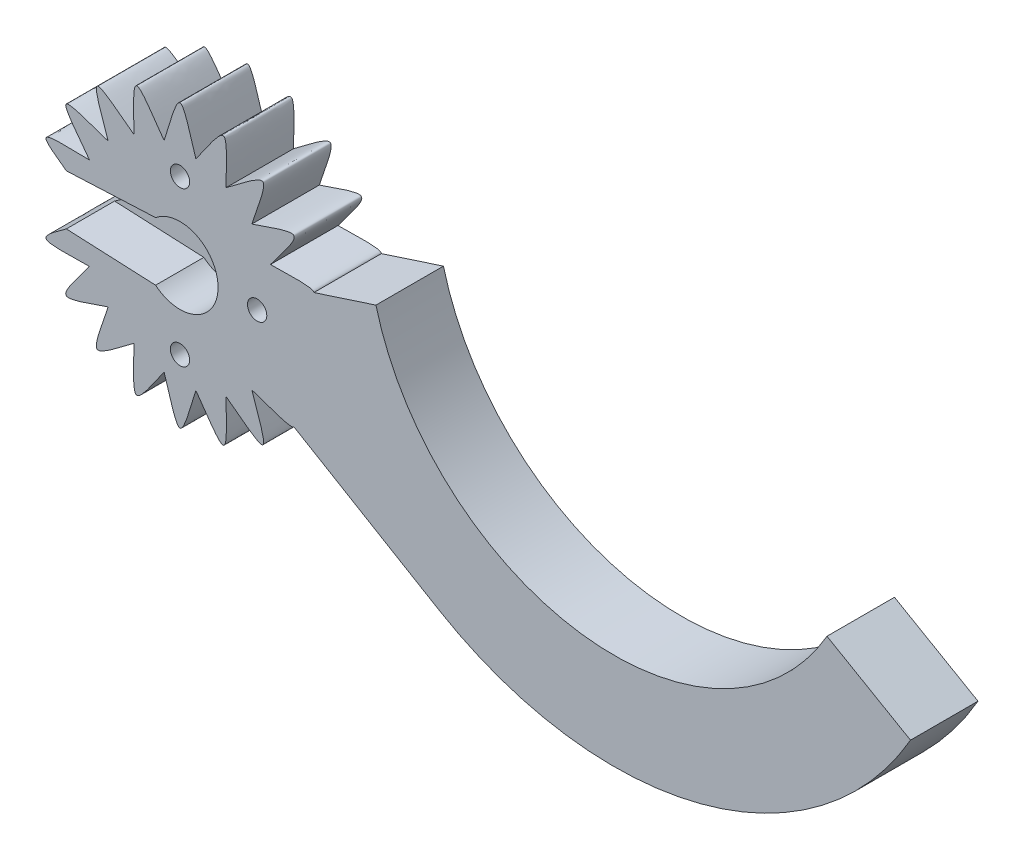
ISO-10303-21;
HEADER;
FILE_DESCRIPTION(('STEP AP214'),'2;1');
FILE_NAME('part.step','',(''),(''),'','','');
FILE_SCHEMA(('AUTOMOTIVE_DESIGN { 1 0 10303 214 1 1 1 1 }'));
ENDSEC;
DATA;
#1=APPLICATION_CONTEXT('core data for automotive mechanical design processes');
#2=APPLICATION_PROTOCOL_DEFINITION('international standard','automotive_design',2000,#1);
#3=PRODUCT_CONTEXT('',#1,'mechanical');
#4=PRODUCT('Part','Part','',(#3));
#5=PRODUCT_RELATED_PRODUCT_CATEGORY('part','',(#4));
#6=PRODUCT_DEFINITION_FORMATION('','',#4);
#7=PRODUCT_DEFINITION_CONTEXT('part definition',#1,'design');
#8=PRODUCT_DEFINITION('design','',#6,#7);
#9=PRODUCT_DEFINITION_SHAPE('','',#8);
#10=(LENGTH_UNIT() NAMED_UNIT(*) SI_UNIT(.MILLI.,.METRE.));
#11=(NAMED_UNIT(*) PLANE_ANGLE_UNIT() SI_UNIT($,.RADIAN.));
#12=(NAMED_UNIT(*) SI_UNIT($,.STERADIAN.) SOLID_ANGLE_UNIT());
#13=UNCERTAINTY_MEASURE_WITH_UNIT(LENGTH_MEASURE(1.E-05),#10,'distance_accuracy_value','');
#14=(GEOMETRIC_REPRESENTATION_CONTEXT(3) GLOBAL_UNCERTAINTY_ASSIGNED_CONTEXT((#13)) GLOBAL_UNIT_ASSIGNED_CONTEXT((#10,
#11,#12)) REPRESENTATION_CONTEXT('',''));
#15=CARTESIAN_POINT('',(0.,0.,0.));
#16=DIRECTION('',(0.,0.,1.));
#17=DIRECTION('',(1.,0.,0.));
#18=AXIS2_PLACEMENT_3D('',#15,#16,#17);
#19=CARTESIAN_POINT('',(-55.4000000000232,-14.647198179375,7.00000000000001));
#20=CARTESIAN_POINT('',(-61.0000000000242,-13.0000000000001,7.));
#21=CARTESIAN_POINT('',(-55.4000000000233,-11.3528018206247,6.99999999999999));
#22=(BOUNDED_CURVE() B_SPLINE_CURVE(2,(#19,#20,#21),.UNSPECIFIED.,.F.,
.F.) B_SPLINE_CURVE_WITH_KNOTS((3,3),(0.,1.),
.UNSPECIFIED.) CURVE() GEOMETRIC_REPRESENTATION_ITEM() RATIONAL_B_SPLINE_CURVE((1.,3.,1.)) REPRESENTATION_ITEM(''));
#23=DIRECTION('',(0.,0.,-1.));
#24=VECTOR('',#23,1.);
#25=SURFACE_OF_LINEAR_EXTRUSION('',#22,#24);
#26=DIRECTION('',(0.,0.,-1.));
#27=VECTOR('',#26,1.);
#28=CARTESIAN_POINT('',(-55.4000000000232,-14.647198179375,7.00000000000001));
#29=LINE('',#28,#27);
#30=CARTESIAN_POINT('',(-55.4000000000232,-14.647198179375,1.99999999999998));
#31=VERTEX_POINT('',#30);
#32=CARTESIAN_POINT('',(-55.4000000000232,-14.647198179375,0.));
#33=VERTEX_POINT('',#32);
#34=EDGE_CURVE('E549',#31,#33,#29,.T.);
#35=ORIENTED_EDGE('',*,*,#34,.F.);
#36=CARTESIAN_POINT('',(-55.4000000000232,-14.647198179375,2.00000000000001));
#37=CARTESIAN_POINT('',(-61.0000000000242,-13.0000000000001,2.));
#38=CARTESIAN_POINT('',(-55.4000000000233,-11.3528018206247,1.99999999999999));
#39=(BOUNDED_CURVE() B_SPLINE_CURVE(2,(#36,#37,#38),.UNSPECIFIED.,.F.,
.F.) B_SPLINE_CURVE_WITH_KNOTS((3,3),(0.,1.),
.UNSPECIFIED.) CURVE() GEOMETRIC_REPRESENTATION_ITEM() RATIONAL_B_SPLINE_CURVE((1.,3.,1.)) REPRESENTATION_ITEM(''));
#40=CARTESIAN_POINT('',(-55.4000000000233,-11.3528018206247,1.99999999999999));
#41=VERTEX_POINT('',#40);
#42=EDGE_CURVE('E440',#31,#41,#39,.T.);
#43=ORIENTED_EDGE('',*,*,#42,.T.);
#44=DIRECTION('',(0.,0.,-1.));
#45=VECTOR('',#44,1.);
#46=CARTESIAN_POINT('',(-55.4000000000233,-11.3528018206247,7.00000000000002));
#47=LINE('',#46,#45);
#48=CARTESIAN_POINT('',(-55.4000000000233,-11.3528018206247,0.));
#49=VERTEX_POINT('',#48);
#50=EDGE_CURVE('E551',#41,#49,#47,.T.);
#51=ORIENTED_EDGE('',*,*,#50,.T.);
#52=CARTESIAN_POINT('',(-55.4000000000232,-14.647198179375,0.));
#53=CARTESIAN_POINT('',(-61.0000000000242,-13.0000000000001,0.));
#54=CARTESIAN_POINT('',(-55.4000000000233,-11.3528018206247,0.));
#55=(BOUNDED_CURVE() B_SPLINE_CURVE(2,(#52,#53,#54),.UNSPECIFIED.,.F.,
.F.) B_SPLINE_CURVE_WITH_KNOTS((3,3),(0.,1.),
.UNSPECIFIED.) CURVE() GEOMETRIC_REPRESENTATION_ITEM() RATIONAL_B_SPLINE_CURVE((1.,3.,1.)) REPRESENTATION_ITEM(''));
#56=EDGE_CURVE('E679',#33,#49,#55,.T.);
#57=ORIENTED_EDGE('',*,*,#56,.F.);
#58=EDGE_LOOP('',(#35,#43,#51,#57));
#59=FACE_BOUND('',#58,.T.);
#60=ADVANCED_FACE('F41',(#59),#25,.T.);
#61=CARTESIAN_POINT('',(-45.,-13.,7.));
#62=DIRECTION('',(0.,0.,-1.));
#63=DIRECTION('',(-1.,0.,0.));
#64=AXIS2_PLACEMENT_3D('',#61,#62,#63);
#65=CYLINDRICAL_SURFACE('',#64,1.);
#66=CARTESIAN_POINT('',(-45.,-13.,0.));
#67=DIRECTION('',(0.,0.,1.));
#68=DIRECTION('',(1.,0.,0.));
#69=AXIS2_PLACEMENT_3D('',#66,#67,#68);
#70=CIRCLE('',#69,1.);
#71=CARTESIAN_POINT('',(-44.,-13.,0.));
#72=VERTEX_POINT('',#71);
#73=EDGE_CURVE('E524',#72,#72,#70,.F.);
#74=ORIENTED_EDGE('',*,*,#73,.T.);
#75=EDGE_LOOP('',(#74));
#76=FACE_BOUND('',#75,.T.);
#77=CARTESIAN_POINT('',(-45.,-13.,2.));
#78=DIRECTION('',(0.,0.,1.));
#79=DIRECTION('',(1.,0.,0.));
#80=AXIS2_PLACEMENT_3D('',#77,#78,#79);
#81=CIRCLE('',#80,1.);
#82=CARTESIAN_POINT('',(-44.,-13.,2.));
#83=VERTEX_POINT('',#82);
#84=EDGE_CURVE('E473',#83,#83,#81,.F.);
#85=ORIENTED_EDGE('',*,*,#84,.F.);
#86=EDGE_LOOP('',(#85));
#87=FACE_BOUND('',#86,.T.);
#88=ADVANCED_FACE('F304',(#76,#87),#65,.F.);
#89=CARTESIAN_POINT('',(-52.9999999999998,-13.0000000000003,7.));
#90=DIRECTION('',(0.,0.,-1.));
#91=DIRECTION('',(-1.,0.,0.));
#92=AXIS2_PLACEMENT_3D('',#89,#90,#91);
#93=CYLINDRICAL_SURFACE('',#92,1.);
#94=CARTESIAN_POINT('',(-52.9999999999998,-13.0000000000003,0.));
#95=DIRECTION('',(0.,0.,1.));
#96=DIRECTION('',(1.,0.,0.));
#97=AXIS2_PLACEMENT_3D('',#94,#95,#96);
#98=CIRCLE('',#97,1.);
#99=CARTESIAN_POINT('',(-51.9999999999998,-13.0000000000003,0.));
#100=VERTEX_POINT('',#99);
#101=EDGE_CURVE('E430',#100,#100,#98,.F.);
#102=ORIENTED_EDGE('',*,*,#101,.T.);
#103=EDGE_LOOP('',(#102));
#104=FACE_BOUND('',#103,.T.);
#105=CARTESIAN_POINT('',(-52.9999999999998,-13.0000000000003,2.));
#106=DIRECTION('',(0.,0.,1.));
#107=DIRECTION('',(1.,0.,0.));
#108=AXIS2_PLACEMENT_3D('',#105,#106,#107);
#109=CIRCLE('',#108,1.);
#110=CARTESIAN_POINT('',(-51.9999999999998,-13.0000000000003,2.));
#111=VERTEX_POINT('',#110);
#112=EDGE_CURVE('E468',#111,#111,#109,.F.);
#113=ORIENTED_EDGE('',*,*,#112,.F.);
#114=EDGE_LOOP('',(#113));
#115=FACE_BOUND('',#114,.T.);
#116=ADVANCED_FACE('F493',(#104,#115),#93,.F.);
#117=CARTESIAN_POINT('',(-35.6180244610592,-17.7803553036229,6.99999999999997));
#118=CARTESIAN_POINT('',(-32.0557280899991,-22.4045640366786,7.00000000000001));
#119=CARTESIAN_POINT('',(-37.5544220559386,-20.445577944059,6.99999999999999));
#120=(BOUNDED_CURVE() B_SPLINE_CURVE(2,(#117,#118,#119),.UNSPECIFIED.,.F.,
.F.) B_SPLINE_CURVE_WITH_KNOTS((3,3),(0.,1.),
.UNSPECIFIED.) CURVE() GEOMETRIC_REPRESENTATION_ITEM() RATIONAL_B_SPLINE_CURVE((1.,3.,1.)) REPRESENTATION_ITEM(''));
#121=DIRECTION('',(0.,0.,-1.));
#122=VECTOR('',#121,1.);
#123=SURFACE_OF_LINEAR_EXTRUSION('',#120,#122);
#124=CARTESIAN_POINT('',(-35.6180244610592,-17.7803553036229,0.));
#125=CARTESIAN_POINT('',(-32.0557280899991,-22.4045640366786,0.));
#126=CARTESIAN_POINT('',(-37.5544220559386,-20.445577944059,0.));
#127=(BOUNDED_CURVE() B_SPLINE_CURVE(2,(#124,#125,#126),.UNSPECIFIED.,.F.,
.F.) B_SPLINE_CURVE_WITH_KNOTS((3,3),(0.,1.),
.UNSPECIFIED.) CURVE() GEOMETRIC_REPRESENTATION_ITEM() RATIONAL_B_SPLINE_CURVE((1.,3.,1.)) REPRESENTATION_ITEM(''));
#128=CARTESIAN_POINT('',(-33.1883518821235,-21.5816646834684,0.));
#129=VERTEX_POINT('',#128);
#130=CARTESIAN_POINT('',(-37.5544220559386,-20.445577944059,0.));
#131=VERTEX_POINT('',#130);
#132=EDGE_CURVE('E439',#129,#131,#127,.T.);
#133=ORIENTED_EDGE('',*,*,#132,.F.);
#134=DIRECTION('',(0.,0.,-1.));
#135=VECTOR('',#134,1.);
#136=CARTESIAN_POINT('',(-33.1883518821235,-21.5816646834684,7.));
#137=LINE('',#136,#135);
#138=CARTESIAN_POINT('',(-33.1883518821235,-21.5816646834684,7.));
#139=VERTEX_POINT('',#138);
#140=EDGE_CURVE('E50',#139,#129,#137,.T.);
#141=ORIENTED_EDGE('',*,*,#140,.F.);
#142=CARTESIAN_POINT('',(-37.5544220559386,-20.445577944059,6.99999999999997));
#143=VERTEX_POINT('',#142);
#144=EDGE_CURVE('E425',#139,#143,#120,.T.);
#145=ORIENTED_EDGE('',*,*,#144,.T.);
#146=DIRECTION('',(0.,0.,-1.));
#147=VECTOR('',#146,1.);
#148=CARTESIAN_POINT('',(-37.5544220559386,-20.445577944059,6.99999999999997));
#149=LINE('',#148,#147);
#150=EDGE_CURVE('E66',#143,#131,#149,.T.);
#151=ORIENTED_EDGE('',*,*,#150,.T.);
#152=EDGE_LOOP('',(#133,#141,#145,#151));
#153=FACE_BOUND('',#152,.T.);
#154=ADVANCED_FACE('F43',(#153),#123,.T.);
#155=CARTESIAN_POINT('',(-18.1223197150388,-30.5259156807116,7.));
#156=DIRECTION('',(0.510487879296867,0.859884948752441,0.));
#157=DIRECTION('',(-0.859884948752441,0.510487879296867,0.));
#158=AXIS2_PLACEMENT_3D('',#155,#156,#157);
#159=PLANE('',#158);
#160=DIRECTION('',(0.859884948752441,-0.510487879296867,0.));
#161=VECTOR('',#160,1.);
#162=CARTESIAN_POINT('',(-18.1223197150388,-30.5259156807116,0.));
#163=LINE('',#162,#161);
#164=CARTESIAN_POINT('',(-18.1223197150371,-30.5259156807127,0.));
#165=VERTEX_POINT('',#164);
#166=EDGE_CURVE('E584',#129,#165,#163,.T.);
#167=ORIENTED_EDGE('',*,*,#166,.T.);
#168=DIRECTION('',(0.,0.,-1.));
#169=VECTOR('',#168,1.);
#170=CARTESIAN_POINT('',(-18.1223197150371,-30.5259156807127,7.));
#171=LINE('',#170,#169);
#172=CARTESIAN_POINT('',(-18.1223197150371,-30.5259156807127,7.));
#173=VERTEX_POINT('',#172);
#174=EDGE_CURVE('E578',#173,#165,#171,.T.);
#175=ORIENTED_EDGE('',*,*,#174,.F.);
#176=DIRECTION('',(0.859884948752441,-0.510487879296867,0.));
#177=VECTOR('',#176,1.);
#178=CARTESIAN_POINT('',(-18.1223197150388,-30.5259156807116,7.));
#179=LINE('',#178,#177);
#180=EDGE_CURVE('E424',#139,#173,#179,.T.);
#181=ORIENTED_EDGE('',*,*,#180,.F.);
#182=ORIENTED_EDGE('',*,*,#140,.T.);
#183=EDGE_LOOP('',(#167,#175,#181,#182));
#184=FACE_BOUND('',#183,.T.);
#185=ADVANCED_FACE('F582',(#184),#159,.F.);
#186=CARTESIAN_POINT('',(0.,0.,7.));
#187=DIRECTION('',(0.,0.,-1.));
#188=DIRECTION('',(-1.,0.,0.));
#189=AXIS2_PLACEMENT_3D('',#186,#187,#188);
#190=CYLINDRICAL_SURFACE('',#189,35.5);
#191=CARTESIAN_POINT('',(0.,0.,0.));
#192=DIRECTION('',(0.,0.,1.));
#193=DIRECTION('',(1.,0.,0.));
#194=AXIS2_PLACEMENT_3D('',#191,#192,#193);
#195=CIRCLE('',#194,35.5);
#196=CARTESIAN_POINT('',(30.7439018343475,-17.7500000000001,0.));
#197=VERTEX_POINT('',#196);
#198=EDGE_CURVE('E591',#197,#165,#195,.F.);
#199=ORIENTED_EDGE('',*,*,#198,.F.);
#200=DIRECTION('',(0.,0.,-1.));
#201=VECTOR('',#200,1.);
#202=CARTESIAN_POINT('',(30.7439018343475,-17.7500000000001,7.));
#203=LINE('',#202,#201);
#204=CARTESIAN_POINT('',(30.7439018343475,-17.7500000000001,7.));
#205=VERTEX_POINT('',#204);
#206=EDGE_CURVE('E576',#205,#197,#203,.T.);
#207=ORIENTED_EDGE('',*,*,#206,.F.);
#208=CARTESIAN_POINT('',(0.,0.,7.));
#209=DIRECTION('',(0.,0.,1.));
#210=DIRECTION('',(1.,0.,0.));
#211=AXIS2_PLACEMENT_3D('',#208,#209,#210);
#212=CIRCLE('',#211,35.5);
#213=EDGE_CURVE('E421',#205,#173,#212,.F.);
#214=ORIENTED_EDGE('',*,*,#213,.T.);
#215=ORIENTED_EDGE('',*,*,#174,.T.);
#216=EDGE_LOOP('',(#199,#207,#214,#215));
#217=FACE_BOUND('',#216,.T.);
#218=ADVANCED_FACE('F735',(#217),#190,.T.);
#219=CARTESIAN_POINT('',(0.,0.,7.));
#220=DIRECTION('',(0.500000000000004,0.866025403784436,0.));
#221=DIRECTION('',(-0.866025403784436,0.500000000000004,0.));
#222=AXIS2_PLACEMENT_3D('',#219,#220,#221);
#223=PLANE('',#222);
#224=DIRECTION('',(0.866025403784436,-0.500000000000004,0.));
#225=VECTOR('',#224,1.);
#226=CARTESIAN_POINT('',(0.,0.,0.));
#227=LINE('',#226,#225);
#228=CARTESIAN_POINT('',(22.0836477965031,-12.7500000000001,0.));
#229=VERTEX_POINT('',#228);
#230=EDGE_CURVE('E603',#229,#197,#227,.T.);
#231=ORIENTED_EDGE('',*,*,#230,.F.);
#232=DIRECTION('',(0.,0.,-1.));
#233=VECTOR('',#232,1.);
#234=CARTESIAN_POINT('',(22.0836477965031,-12.7500000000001,7.));
#235=LINE('',#234,#233);
#236=CARTESIAN_POINT('',(22.0836477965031,-12.7500000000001,7.));
#237=VERTEX_POINT('',#236);
#238=EDGE_CURVE('E574',#237,#229,#235,.T.);
#239=ORIENTED_EDGE('',*,*,#238,.F.);
#240=DIRECTION('',(0.866025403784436,-0.500000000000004,0.));
#241=VECTOR('',#240,1.);
#242=CARTESIAN_POINT('',(0.,0.,7.));
#243=LINE('',#242,#241);
#244=EDGE_CURVE('E418',#237,#205,#243,.T.);
#245=ORIENTED_EDGE('',*,*,#244,.T.);
#246=ORIENTED_EDGE('',*,*,#206,.T.);
#247=EDGE_LOOP('',(#231,#239,#245,#246));
#248=FACE_BOUND('',#247,.T.);
#249=ADVANCED_FACE('F738',(#248),#223,.T.);
#250=CARTESIAN_POINT('',(0.,0.,7.));
#251=DIRECTION('',(0.,0.,-1.));
#252=DIRECTION('',(-1.,0.,0.));
#253=AXIS2_PLACEMENT_3D('',#250,#251,#252);
#254=CYLINDRICAL_SURFACE('',#253,25.5);
#255=CARTESIAN_POINT('',(0.,0.,0.));
#256=DIRECTION('',(0.,0.,1.));
#257=DIRECTION('',(1.,0.,0.));
#258=AXIS2_PLACEMENT_3D('',#255,#256,#257);
#259=CIRCLE('',#258,25.5);
#260=CARTESIAN_POINT('',(-24.6840713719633,-6.39895464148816,0.));
#261=VERTEX_POINT('',#260);
#262=EDGE_CURVE('E605',#229,#261,#259,.F.);
#263=ORIENTED_EDGE('',*,*,#262,.T.);
#264=DIRECTION('',(0.,0.,-1.));
#265=VECTOR('',#264,1.);
#266=CARTESIAN_POINT('',(-24.6840713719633,-6.39895464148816,7.));
#267=LINE('',#266,#265);
#268=CARTESIAN_POINT('',(-24.6840713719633,-6.39895464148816,7.));
#269=VERTEX_POINT('',#268);
#270=EDGE_CURVE('E571',#269,#261,#267,.T.);
#271=ORIENTED_EDGE('',*,*,#270,.F.);
#272=CARTESIAN_POINT('',(0.,0.,7.));
#273=DIRECTION('',(0.,0.,1.));
#274=DIRECTION('',(1.,0.,0.));
#275=AXIS2_PLACEMENT_3D('',#272,#273,#274);
#276=CIRCLE('',#275,25.5);
#277=EDGE_CURVE('E416',#237,#269,#276,.F.);
#278=ORIENTED_EDGE('',*,*,#277,.F.);
#279=ORIENTED_EDGE('',*,*,#238,.T.);
#280=EDGE_LOOP('',(#263,#271,#278,#279));
#281=FACE_BOUND('',#280,.T.);
#282=ADVANCED_FACE('F745',(#281),#254,.F.);
#283=CARTESIAN_POINT('',(-0.47651348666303,1.46655771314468,7.));
#284=DIRECTION('',(0.309016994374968,-0.951056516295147,0.));
#285=DIRECTION('',(0.951056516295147,0.309016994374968,0.));
#286=AXIS2_PLACEMENT_3D('',#283,#284,#285);
#287=PLANE('',#286);
#288=DIRECTION('',(-0.951056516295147,-0.309016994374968,0.));
#289=VECTOR('',#288,1.);
#290=CARTESIAN_POINT('',(-0.47651348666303,1.46655771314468,0.));
#291=LINE('',#290,#289);
#292=CARTESIAN_POINT('',(-31.1145748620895,-8.48835188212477,0.));
#293=VERTEX_POINT('',#292);
#294=EDGE_CURVE('E607',#261,#293,#291,.T.);
#295=ORIENTED_EDGE('',*,*,#294,.T.);
#296=DIRECTION('',(0.,0.,-1.));
#297=VECTOR('',#296,1.);
#298=CARTESIAN_POINT('',(-31.1145748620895,-8.48835188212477,7.));
#299=LINE('',#298,#297);
#300=CARTESIAN_POINT('',(-31.1145748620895,-8.48835188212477,7.));
#301=VERTEX_POINT('',#300);
#302=EDGE_CURVE('E569',#301,#293,#299,.T.);
#303=ORIENTED_EDGE('',*,*,#302,.F.);
#304=DIRECTION('',(-0.951056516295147,-0.309016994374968,0.));
#305=VECTOR('',#304,1.);
#306=CARTESIAN_POINT('',(-0.47651348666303,1.46655771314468,7.));
#307=LINE('',#306,#305);
#308=EDGE_CURVE('E411',#269,#301,#307,.T.);
#309=ORIENTED_EDGE('',*,*,#308,.F.);
#310=ORIENTED_EDGE('',*,*,#270,.T.);
#311=EDGE_LOOP('',(#295,#303,#309,#310));
#312=FACE_BOUND('',#311,.T.);
#313=ADVANCED_FACE('F749',(#312),#287,.F.);
#314=CARTESIAN_POINT('',(-35.6180244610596,-8.21964469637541,7.));
#315=CARTESIAN_POINT('',(-29.7830957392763,-8.05572808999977,7.));
#316=CARTESIAN_POINT('',(-34.5999999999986,-11.3528018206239,7.00000000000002));
#317=(BOUNDED_CURVE() B_SPLINE_CURVE(2,(#314,#315,#316),.UNSPECIFIED.,.F.,
.F.) B_SPLINE_CURVE_WITH_KNOTS((3,3),(0.,1.),
.UNSPECIFIED.) CURVE() GEOMETRIC_REPRESENTATION_ITEM() RATIONAL_B_SPLINE_CURVE((1.,3.,1.)) REPRESENTATION_ITEM(''));
#318=DIRECTION('',(0.,0.,-1.));
#319=VECTOR('',#318,1.);
#320=SURFACE_OF_LINEAR_EXTRUSION('',#317,#319);
#321=CARTESIAN_POINT('',(-35.6180244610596,-8.21964469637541,0.));
#322=CARTESIAN_POINT('',(-29.7830957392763,-8.05572808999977,0.));
#323=CARTESIAN_POINT('',(-34.5999999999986,-11.3528018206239,0.));
#324=(BOUNDED_CURVE() B_SPLINE_CURVE(2,(#321,#322,#323),.UNSPECIFIED.,.F.,
.F.) B_SPLINE_CURVE_WITH_KNOTS((3,3),(0.,1.),
.UNSPECIFIED.) CURVE() GEOMETRIC_REPRESENTATION_ITEM() RATIONAL_B_SPLINE_CURVE((1.,3.,1.)) REPRESENTATION_ITEM(''));
#325=CARTESIAN_POINT('',(-35.6180244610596,-8.21964469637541,0.));
#326=VERTEX_POINT('',#325);
#327=EDGE_CURVE('E610',#326,#293,#324,.T.);
#328=ORIENTED_EDGE('',*,*,#327,.F.);
#329=DIRECTION('',(0.,0.,-1.));
#330=VECTOR('',#329,1.);
#331=CARTESIAN_POINT('',(-35.6180244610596,-8.21964469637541,7.));
#332=LINE('',#331,#330);
#333=CARTESIAN_POINT('',(-35.6180244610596,-8.21964469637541,7.));
#334=VERTEX_POINT('',#333);
#335=EDGE_CURVE('E567',#334,#326,#332,.T.);
#336=ORIENTED_EDGE('',*,*,#335,.F.);
#337=EDGE_CURVE('E402',#334,#301,#317,.T.);
#338=ORIENTED_EDGE('',*,*,#337,.T.);
#339=ORIENTED_EDGE('',*,*,#302,.T.);
#340=EDGE_LOOP('',(#328,#336,#338,#339));
#341=FACE_BOUND('',#340,.T.);
#342=ADVANCED_FACE('F393',(#341),#320,.T.);
#343=CARTESIAN_POINT('',(-37.5544220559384,-5.55442205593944,7.00000000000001));
#344=CARTESIAN_POINT('',(-32.0557280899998,-3.59543596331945,6.99999999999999));
#345=CARTESIAN_POINT('',(-35.6180244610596,-8.21964469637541,7.00000000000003));
#346=(BOUNDED_CURVE() B_SPLINE_CURVE(2,(#343,#344,#345),.UNSPECIFIED.,.F.,
.F.) B_SPLINE_CURVE_WITH_KNOTS((3,3),(0.,1.),
.UNSPECIFIED.) CURVE() GEOMETRIC_REPRESENTATION_ITEM() RATIONAL_B_SPLINE_CURVE((1.,3.,1.)) REPRESENTATION_ITEM(''));
#347=DIRECTION('',(0.,0.,-1.));
#348=VECTOR('',#347,1.);
#349=SURFACE_OF_LINEAR_EXTRUSION('',#346,#348);
#350=CARTESIAN_POINT('',(-37.5544220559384,-5.55442205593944,0.));
#351=CARTESIAN_POINT('',(-32.0557280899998,-3.59543596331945,0.));
#352=CARTESIAN_POINT('',(-35.6180244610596,-8.21964469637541,0.));
#353=(BOUNDED_CURVE() B_SPLINE_CURVE(2,(#350,#351,#352),.UNSPECIFIED.,.F.,
.F.) B_SPLINE_CURVE_WITH_KNOTS((3,3),(0.,1.),
.UNSPECIFIED.) CURVE() GEOMETRIC_REPRESENTATION_ITEM() RATIONAL_B_SPLINE_CURVE((1.,3.,1.)) REPRESENTATION_ITEM(''));
#354=CARTESIAN_POINT('',(-37.5544220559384,-5.55442205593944,0.));
#355=VERTEX_POINT('',#354);
#356=EDGE_CURVE('E615',#355,#326,#353,.T.);
#357=ORIENTED_EDGE('',*,*,#356,.F.);
#358=DIRECTION('',(0.,0.,-1.));
#359=VECTOR('',#358,1.);
#360=CARTESIAN_POINT('',(-37.5544220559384,-5.55442205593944,7.00000000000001));
#361=LINE('',#360,#359);
#362=CARTESIAN_POINT('',(-37.5544220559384,-5.55442205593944,7.00000000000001));
#363=VERTEX_POINT('',#362);
#364=EDGE_CURVE('E565',#363,#355,#361,.T.);
#365=ORIENTED_EDGE('',*,*,#364,.F.);
#366=EDGE_CURVE('E397',#363,#334,#346,.T.);
#367=ORIENTED_EDGE('',*,*,#366,.T.);
#368=ORIENTED_EDGE('',*,*,#335,.T.);
#369=EDGE_LOOP('',(#357,#365,#367,#368));
#370=FACE_BOUND('',#369,.T.);
#371=ADVANCED_FACE('F389',(#370),#349,.T.);
#372=CARTESIAN_POINT('',(-40.2196446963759,-3.61802446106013,7.00000000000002));
#373=CARTESIAN_POINT('',(-35.5954359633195,-0.0557280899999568,6.99999999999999));
#374=CARTESIAN_POINT('',(-37.5544220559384,-5.55442205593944,7.00000000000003));
#375=(BOUNDED_CURVE() B_SPLINE_CURVE(2,(#372,#373,#374),.UNSPECIFIED.,.F.,
.F.) B_SPLINE_CURVE_WITH_KNOTS((3,3),(0.,1.),
.UNSPECIFIED.) CURVE() GEOMETRIC_REPRESENTATION_ITEM() RATIONAL_B_SPLINE_CURVE((1.,3.,1.)) REPRESENTATION_ITEM(''));
#376=DIRECTION('',(0.,0.,-1.));
#377=VECTOR('',#376,1.);
#378=SURFACE_OF_LINEAR_EXTRUSION('',#375,#377);
#379=CARTESIAN_POINT('',(-40.2196446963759,-3.61802446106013,0.));
#380=CARTESIAN_POINT('',(-35.5954359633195,-0.0557280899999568,0.));
#381=CARTESIAN_POINT('',(-37.5544220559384,-5.55442205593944,0.));
#382=(BOUNDED_CURVE() B_SPLINE_CURVE(2,(#379,#380,#381),.UNSPECIFIED.,.F.,
.F.) B_SPLINE_CURVE_WITH_KNOTS((3,3),(0.,1.),
.UNSPECIFIED.) CURVE() GEOMETRIC_REPRESENTATION_ITEM() RATIONAL_B_SPLINE_CURVE((1.,3.,1.)) REPRESENTATION_ITEM(''));
#383=CARTESIAN_POINT('',(-40.2196446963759,-3.61802446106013,0.));
#384=VERTEX_POINT('',#383);
#385=EDGE_CURVE('E623',#384,#355,#382,.T.);
#386=ORIENTED_EDGE('',*,*,#385,.F.);
#387=DIRECTION('',(0.,0.,-1.));
#388=VECTOR('',#387,1.);
#389=CARTESIAN_POINT('',(-40.2196446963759,-3.61802446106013,7.00000000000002));
#390=LINE('',#389,#388);
#391=CARTESIAN_POINT('',(-40.2196446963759,-3.61802446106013,7.00000000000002));
#392=VERTEX_POINT('',#391);
#393=EDGE_CURVE('E563',#392,#384,#390,.T.);
#394=ORIENTED_EDGE('',*,*,#393,.F.);
#395=EDGE_CURVE('E374',#392,#363,#375,.T.);
#396=ORIENTED_EDGE('',*,*,#395,.T.);
#397=ORIENTED_EDGE('',*,*,#364,.T.);
#398=EDGE_LOOP('',(#386,#394,#396,#397));
#399=FACE_BOUND('',#398,.T.);
#400=ADVANCED_FACE('F385',(#399),#378,.T.);
#401=CARTESIAN_POINT('',(-43.3528018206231,-2.59999999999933,7.00000000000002));
#402=CARTESIAN_POINT('',(-40.05572809,2.21690426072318,6.99999999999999));
#403=CARTESIAN_POINT('',(-40.2196446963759,-3.61802446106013,7.00000000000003));
#404=(BOUNDED_CURVE() B_SPLINE_CURVE(2,(#401,#402,#403),.UNSPECIFIED.,.F.,
.F.) B_SPLINE_CURVE_WITH_KNOTS((3,3),(0.,1.),
.UNSPECIFIED.) CURVE() GEOMETRIC_REPRESENTATION_ITEM() RATIONAL_B_SPLINE_CURVE((1.,3.,1.)) REPRESENTATION_ITEM(''));
#405=DIRECTION('',(0.,0.,-1.));
#406=VECTOR('',#405,1.);
#407=SURFACE_OF_LINEAR_EXTRUSION('',#404,#406);
#408=CARTESIAN_POINT('',(-43.3528018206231,-2.59999999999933,0.));
#409=CARTESIAN_POINT('',(-40.05572809,2.21690426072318,0.));
#410=CARTESIAN_POINT('',(-40.2196446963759,-3.61802446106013,0.));
#411=(BOUNDED_CURVE() B_SPLINE_CURVE(2,(#408,#409,#410),.UNSPECIFIED.,.F.,
.F.) B_SPLINE_CURVE_WITH_KNOTS((3,3),(0.,1.),
.UNSPECIFIED.) CURVE() GEOMETRIC_REPRESENTATION_ITEM() RATIONAL_B_SPLINE_CURVE((1.,3.,1.)) REPRESENTATION_ITEM(''));
#412=CARTESIAN_POINT('',(-43.3528018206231,-2.59999999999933,0.));
#413=VERTEX_POINT('',#412);
#414=EDGE_CURVE('E631',#413,#384,#411,.T.);
#415=ORIENTED_EDGE('',*,*,#414,.F.);
#416=DIRECTION('',(0.,0.,-1.));
#417=VECTOR('',#416,1.);
#418=CARTESIAN_POINT('',(-43.3528018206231,-2.59999999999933,7.00000000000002));
#419=LINE('',#418,#417);
#420=CARTESIAN_POINT('',(-43.3528018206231,-2.59999999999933,7.00000000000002));
#421=VERTEX_POINT('',#420);
#422=EDGE_CURVE('E561',#421,#413,#419,.T.);
#423=ORIENTED_EDGE('',*,*,#422,.F.);
#424=EDGE_CURVE('E365',#421,#392,#404,.T.);
#425=ORIENTED_EDGE('',*,*,#424,.T.);
#426=ORIENTED_EDGE('',*,*,#393,.T.);
#427=EDGE_LOOP('',(#415,#423,#425,#426));
#428=FACE_BOUND('',#427,.T.);
#429=ADVANCED_FACE('F382',(#428),#407,.T.);
#430=CARTESIAN_POINT('',(-46.6471981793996,-2.59999999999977,7.00000000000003));
#431=CARTESIAN_POINT('',(-45.0000000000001,3.00000000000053,6.99999999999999));
#432=CARTESIAN_POINT('',(-43.3528018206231,-2.59999999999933,7.00000000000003));
#433=(BOUNDED_CURVE() B_SPLINE_CURVE(2,(#430,#431,#432),.UNSPECIFIED.,.F.,
.F.) B_SPLINE_CURVE_WITH_KNOTS((3,3),(0.,1.),
.UNSPECIFIED.) CURVE() GEOMETRIC_REPRESENTATION_ITEM() RATIONAL_B_SPLINE_CURVE((1.,3.,1.)) REPRESENTATION_ITEM(''));
#434=DIRECTION('',(0.,0.,-1.));
#435=VECTOR('',#434,1.);
#436=SURFACE_OF_LINEAR_EXTRUSION('',#433,#435);
#437=CARTESIAN_POINT('',(-46.6471981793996,-2.59999999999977,0.));
#438=CARTESIAN_POINT('',(-45.0000000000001,3.00000000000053,0.));
#439=CARTESIAN_POINT('',(-43.3528018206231,-2.59999999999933,0.));
#440=(BOUNDED_CURVE() B_SPLINE_CURVE(2,(#437,#438,#439),.UNSPECIFIED.,.F.,
.F.) B_SPLINE_CURVE_WITH_KNOTS((3,3),(0.,1.),
.UNSPECIFIED.) CURVE() GEOMETRIC_REPRESENTATION_ITEM() RATIONAL_B_SPLINE_CURVE((1.,3.,1.)) REPRESENTATION_ITEM(''));
#441=CARTESIAN_POINT('',(-46.6471981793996,-2.59999999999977,0.));
#442=VERTEX_POINT('',#441);
#443=EDGE_CURVE('E639',#442,#413,#440,.T.);
#444=ORIENTED_EDGE('',*,*,#443,.F.);
#445=DIRECTION('',(0.,0.,-1.));
#446=VECTOR('',#445,1.);
#447=CARTESIAN_POINT('',(-46.6471981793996,-2.59999999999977,7.00000000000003));
#448=LINE('',#447,#446);
#449=CARTESIAN_POINT('',(-46.6471981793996,-2.59999999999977,7.00000000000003));
#450=VERTEX_POINT('',#449);
#451=EDGE_CURVE('E559',#450,#442,#448,.T.);
#452=ORIENTED_EDGE('',*,*,#451,.F.);
#453=EDGE_CURVE('E356',#450,#421,#433,.T.);
#454=ORIENTED_EDGE('',*,*,#453,.T.);
#455=ORIENTED_EDGE('',*,*,#422,.T.);
#456=EDGE_LOOP('',(#444,#452,#454,#455));
#457=FACE_BOUND('',#456,.T.);
#458=ADVANCED_FACE('F347',(#457),#436,.T.);
#459=CARTESIAN_POINT('',(-49.7803553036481,-3.61802446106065,7.00000000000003));
#460=CARTESIAN_POINT('',(-49.9442719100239,2.21690426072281,6.99999999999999));
#461=CARTESIAN_POINT('',(-46.6471981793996,-2.59999999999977,7.00000000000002));
#462=(BOUNDED_CURVE() B_SPLINE_CURVE(2,(#459,#460,#461),.UNSPECIFIED.,.F.,
.F.) B_SPLINE_CURVE_WITH_KNOTS((3,3),(0.,1.),
.UNSPECIFIED.) CURVE() GEOMETRIC_REPRESENTATION_ITEM() RATIONAL_B_SPLINE_CURVE((1.,3.,1.)) REPRESENTATION_ITEM(''));
#463=DIRECTION('',(0.,0.,-1.));
#464=VECTOR('',#463,1.);
#465=SURFACE_OF_LINEAR_EXTRUSION('',#462,#464);
#466=CARTESIAN_POINT('',(-49.7803553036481,-3.61802446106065,0.));
#467=CARTESIAN_POINT('',(-49.9442719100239,2.21690426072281,0.));
#468=CARTESIAN_POINT('',(-46.6471981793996,-2.59999999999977,0.));
#469=(BOUNDED_CURVE() B_SPLINE_CURVE(2,(#466,#467,#468),.UNSPECIFIED.,.F.,
.F.) B_SPLINE_CURVE_WITH_KNOTS((3,3),(0.,1.),
.UNSPECIFIED.) CURVE() GEOMETRIC_REPRESENTATION_ITEM() RATIONAL_B_SPLINE_CURVE((1.,3.,1.)) REPRESENTATION_ITEM(''));
#470=CARTESIAN_POINT('',(-49.7803553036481,-3.61802446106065,0.));
#471=VERTEX_POINT('',#470);
#472=EDGE_CURVE('E647',#471,#442,#469,.T.);
#473=ORIENTED_EDGE('',*,*,#472,.F.);
#474=DIRECTION('',(0.,0.,-1.));
#475=VECTOR('',#474,1.);
#476=CARTESIAN_POINT('',(-49.7803553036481,-3.61802446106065,7.00000000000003));
#477=LINE('',#476,#475);
#478=CARTESIAN_POINT('',(-49.7803553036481,-3.61802446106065,7.00000000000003));
#479=VERTEX_POINT('',#478);
#480=EDGE_CURVE('E557',#479,#471,#477,.T.);
#481=ORIENTED_EDGE('',*,*,#480,.F.);
#482=EDGE_CURVE('E351',#479,#450,#462,.T.);
#483=ORIENTED_EDGE('',*,*,#482,.T.);
#484=ORIENTED_EDGE('',*,*,#451,.T.);
#485=EDGE_LOOP('',(#473,#481,#483,#484));
#486=FACE_BOUND('',#485,.T.);
#487=ADVANCED_FACE('F343',(#486),#465,.T.);
#488=CARTESIAN_POINT('',(-52.4455779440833,-5.55442205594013,7.00000000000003));
#489=CARTESIAN_POINT('',(-54.4045640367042,-0.0557280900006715,6.99999999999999));
#490=CARTESIAN_POINT('',(-49.7803553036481,-3.61802446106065,7.00000000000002));
#491=(BOUNDED_CURVE() B_SPLINE_CURVE(2,(#488,#489,#490),.UNSPECIFIED.,.F.,
.F.) B_SPLINE_CURVE_WITH_KNOTS((3,3),(0.,1.),
.UNSPECIFIED.) CURVE() GEOMETRIC_REPRESENTATION_ITEM() RATIONAL_B_SPLINE_CURVE((1.,3.,1.)) REPRESENTATION_ITEM(''));
#492=DIRECTION('',(0.,0.,-1.));
#493=VECTOR('',#492,1.);
#494=SURFACE_OF_LINEAR_EXTRUSION('',#491,#493);
#495=CARTESIAN_POINT('',(-52.4455779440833,-5.55442205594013,0.));
#496=CARTESIAN_POINT('',(-54.4045640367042,-0.0557280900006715,0.));
#497=CARTESIAN_POINT('',(-49.7803553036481,-3.61802446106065,0.));
#498=(BOUNDED_CURVE() B_SPLINE_CURVE(2,(#495,#496,#497),.UNSPECIFIED.,.F.,
.F.) B_SPLINE_CURVE_WITH_KNOTS((3,3),(0.,1.),
.UNSPECIFIED.) CURVE() GEOMETRIC_REPRESENTATION_ITEM() RATIONAL_B_SPLINE_CURVE((1.,3.,1.)) REPRESENTATION_ITEM(''));
#499=CARTESIAN_POINT('',(-52.4455779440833,-5.55442205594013,0.));
#500=VERTEX_POINT('',#499);
#501=EDGE_CURVE('E655',#500,#471,#498,.T.);
#502=ORIENTED_EDGE('',*,*,#501,.F.);
#503=DIRECTION('',(0.,0.,-1.));
#504=VECTOR('',#503,1.);
#505=CARTESIAN_POINT('',(-52.4455779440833,-5.55442205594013,7.00000000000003));
#506=LINE('',#505,#504);
#507=CARTESIAN_POINT('',(-52.4455779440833,-5.55442205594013,7.00000000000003));
#508=VERTEX_POINT('',#507);
#509=EDGE_CURVE('E555',#508,#500,#506,.T.);
#510=ORIENTED_EDGE('',*,*,#509,.F.);
#511=EDGE_CURVE('E328',#508,#479,#491,.T.);
#512=ORIENTED_EDGE('',*,*,#511,.T.);
#513=ORIENTED_EDGE('',*,*,#480,.T.);
#514=EDGE_LOOP('',(#502,#510,#512,#513));
#515=FACE_BOUND('',#514,.T.);
#516=ADVANCED_FACE('F339',(#515),#494,.T.);
#517=CARTESIAN_POINT('',(-54.3819755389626,-8.21964469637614,7.00000000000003));
#518=CARTESIAN_POINT('',(-57.9442719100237,-3.59543596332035,6.99999999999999));
#519=CARTESIAN_POINT('',(-52.4455779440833,-5.55442205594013,7.00000000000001));
#520=(BOUNDED_CURVE() B_SPLINE_CURVE(2,(#517,#518,#519),.UNSPECIFIED.,.F.,
.F.) B_SPLINE_CURVE_WITH_KNOTS((3,3),(0.,1.),
.UNSPECIFIED.) CURVE() GEOMETRIC_REPRESENTATION_ITEM() RATIONAL_B_SPLINE_CURVE((1.,3.,1.)) REPRESENTATION_ITEM(''));
#521=DIRECTION('',(0.,0.,-1.));
#522=VECTOR('',#521,1.);
#523=SURFACE_OF_LINEAR_EXTRUSION('',#520,#522);
#524=CARTESIAN_POINT('',(-54.3819755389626,-8.21964469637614,0.));
#525=CARTESIAN_POINT('',(-57.9442719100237,-3.59543596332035,0.));
#526=CARTESIAN_POINT('',(-52.4455779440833,-5.55442205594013,0.));
#527=(BOUNDED_CURVE() B_SPLINE_CURVE(2,(#524,#525,#526),.UNSPECIFIED.,.F.,
.F.) B_SPLINE_CURVE_WITH_KNOTS((3,3),(0.,1.),
.UNSPECIFIED.) CURVE() GEOMETRIC_REPRESENTATION_ITEM() RATIONAL_B_SPLINE_CURVE((1.,3.,1.)) REPRESENTATION_ITEM(''));
#528=CARTESIAN_POINT('',(-54.3819755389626,-8.21964469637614,0.));
#529=VERTEX_POINT('',#528);
#530=EDGE_CURVE('E663',#529,#500,#527,.T.);
#531=ORIENTED_EDGE('',*,*,#530,.F.);
#532=DIRECTION('',(0.,0.,-1.));
#533=VECTOR('',#532,1.);
#534=CARTESIAN_POINT('',(-54.3819755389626,-8.21964469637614,7.00000000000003));
#535=LINE('',#534,#533);
#536=CARTESIAN_POINT('',(-54.3819755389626,-8.21964469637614,7.00000000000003));
#537=VERTEX_POINT('',#536);
#538=EDGE_CURVE('E553',#537,#529,#535,.T.);
#539=ORIENTED_EDGE('',*,*,#538,.F.);
#540=EDGE_CURVE('E319',#537,#508,#520,.T.);
#541=ORIENTED_EDGE('',*,*,#540,.T.);
#542=ORIENTED_EDGE('',*,*,#509,.T.);
#543=EDGE_LOOP('',(#531,#539,#541,#542));
#544=FACE_BOUND('',#543,.T.);
#545=ADVANCED_FACE('F336',(#544),#523,.T.);
#546=CARTESIAN_POINT('',(-55.4000000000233,-11.3528018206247,7.00000000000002));
#547=CARTESIAN_POINT('',(-60.2169042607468,-8.05572809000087,7.));
#548=CARTESIAN_POINT('',(-54.3819755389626,-8.21964469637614,7.));
#549=(BOUNDED_CURVE() B_SPLINE_CURVE(2,(#546,#547,#548),.UNSPECIFIED.,.F.,
.F.) B_SPLINE_CURVE_WITH_KNOTS((3,3),(0.,1.),
.UNSPECIFIED.) CURVE() GEOMETRIC_REPRESENTATION_ITEM() RATIONAL_B_SPLINE_CURVE((1.,3.,1.)) REPRESENTATION_ITEM(''));
#550=DIRECTION('',(0.,0.,-1.));
#551=VECTOR('',#550,1.);
#552=SURFACE_OF_LINEAR_EXTRUSION('',#549,#551);
#553=DIRECTION('',(0.,0.,-1.));
#554=VECTOR('',#553,1.);
#555=CARTESIAN_POINT('',(-56.7838979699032,-10.3931024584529,7.00000000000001));
#556=LINE('',#555,#554);
#557=CARTESIAN_POINT('',(-56.7838979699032,-10.3931024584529,7.));
#558=VERTEX_POINT('',#557);
#559=CARTESIAN_POINT('',(-56.7838979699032,-10.3931024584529,2.));
#560=VERTEX_POINT('',#559);
#561=EDGE_CURVE('E462',#558,#560,#556,.T.);
#562=ORIENTED_EDGE('',*,*,#561,.F.);
#563=EDGE_CURVE('E311',#558,#537,#549,.T.);
#564=ORIENTED_EDGE('',*,*,#563,.T.);
#565=ORIENTED_EDGE('',*,*,#538,.T.);
#566=CARTESIAN_POINT('',(-55.4000000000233,-11.3528018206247,0.));
#567=CARTESIAN_POINT('',(-60.2169042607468,-8.05572809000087,0.));
#568=CARTESIAN_POINT('',(-54.3819755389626,-8.21964469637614,0.));
#569=(BOUNDED_CURVE() B_SPLINE_CURVE(2,(#566,#567,#568),.UNSPECIFIED.,.F.,
.F.) B_SPLINE_CURVE_WITH_KNOTS((3,3),(0.,1.),
.UNSPECIFIED.) CURVE() GEOMETRIC_REPRESENTATION_ITEM() RATIONAL_B_SPLINE_CURVE((1.,3.,1.)) REPRESENTATION_ITEM(''));
#570=EDGE_CURVE('E671',#49,#529,#569,.T.);
#571=ORIENTED_EDGE('',*,*,#570,.F.);
#572=ORIENTED_EDGE('',*,*,#50,.F.);
#573=CARTESIAN_POINT('',(-55.4000000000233,-11.3528018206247,2.00000000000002));
#574=CARTESIAN_POINT('',(-60.2169042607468,-8.05572809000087,2.));
#575=CARTESIAN_POINT('',(-54.3819755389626,-8.21964469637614,2.));
#576=(BOUNDED_CURVE() B_SPLINE_CURVE(2,(#573,#574,#575),.UNSPECIFIED.,.F.,
.F.) B_SPLINE_CURVE_WITH_KNOTS((3,3),(0.,1.),
.UNSPECIFIED.) CURVE() GEOMETRIC_REPRESENTATION_ITEM() RATIONAL_B_SPLINE_CURVE((1.,3.,1.)) REPRESENTATION_ITEM(''));
#577=EDGE_CURVE('E431',#41,#560,#576,.T.);
#578=ORIENTED_EDGE('',*,*,#577,.T.);
#579=EDGE_LOOP('',(#562,#564,#565,#571,#572,#578));
#580=FACE_BOUND('',#579,.T.);
#581=ADVANCED_FACE('F300',(#580),#552,.T.);
#582=CARTESIAN_POINT('',(-54.3819755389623,-17.7803553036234,7.));
#583=CARTESIAN_POINT('',(-60.2169042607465,-17.9442719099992,7.));
#584=CARTESIAN_POINT('',(-55.4000000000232,-14.647198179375,6.99999999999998));
#585=(BOUNDED_CURVE() B_SPLINE_CURVE(2,(#582,#583,#584),.UNSPECIFIED.,.F.,
.F.) B_SPLINE_CURVE_WITH_KNOTS((3,3),(0.,1.),
.UNSPECIFIED.) CURVE() GEOMETRIC_REPRESENTATION_ITEM() RATIONAL_B_SPLINE_CURVE((1.,3.,1.)) REPRESENTATION_ITEM(''));
#586=DIRECTION('',(0.,0.,-1.));
#587=VECTOR('',#586,1.);
#588=SURFACE_OF_LINEAR_EXTRUSION('',#585,#587);
#589=DIRECTION('',(0.,0.,-1.));
#590=VECTOR('',#589,1.);
#591=CARTESIAN_POINT('',(-56.7838979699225,-15.6068975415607,6.99999999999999));
#592=LINE('',#591,#590);
#593=CARTESIAN_POINT('',(-56.7838979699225,-15.6068975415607,2.));
#594=VERTEX_POINT('',#593);
#595=CARTESIAN_POINT('',(-56.7838979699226,-15.6068975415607,7.));
#596=VERTEX_POINT('',#595);
#597=EDGE_CURVE('E456',#594,#596,#592,.F.);
#598=ORIENTED_EDGE('',*,*,#597,.F.);
#599=CARTESIAN_POINT('',(-54.3819755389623,-17.7803553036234,2.));
#600=CARTESIAN_POINT('',(-60.2169042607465,-17.9442719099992,2.));
#601=CARTESIAN_POINT('',(-55.4000000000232,-14.647198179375,1.99999999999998));
#602=(BOUNDED_CURVE() B_SPLINE_CURVE(2,(#599,#600,#601),.UNSPECIFIED.,.F.,
.F.) B_SPLINE_CURVE_WITH_KNOTS((3,3),(0.,1.),
.UNSPECIFIED.) CURVE() GEOMETRIC_REPRESENTATION_ITEM() RATIONAL_B_SPLINE_CURVE((1.,3.,1.)) REPRESENTATION_ITEM(''));
#603=EDGE_CURVE('E448',#594,#31,#602,.T.);
#604=ORIENTED_EDGE('',*,*,#603,.T.);
#605=ORIENTED_EDGE('',*,*,#34,.T.);
#606=CARTESIAN_POINT('',(-54.3819755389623,-17.7803553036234,0.));
#607=CARTESIAN_POINT('',(-60.2169042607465,-17.9442719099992,0.));
#608=CARTESIAN_POINT('',(-55.4000000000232,-14.647198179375,0.));
#609=(BOUNDED_CURVE() B_SPLINE_CURVE(2,(#606,#607,#608),.UNSPECIFIED.,.F.,
.F.) B_SPLINE_CURVE_WITH_KNOTS((3,3),(0.,1.),
.UNSPECIFIED.) CURVE() GEOMETRIC_REPRESENTATION_ITEM() RATIONAL_B_SPLINE_CURVE((1.,3.,1.)) REPRESENTATION_ITEM(''));
#610=CARTESIAN_POINT('',(-54.3819755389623,-17.7803553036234,0.));
#611=VERTEX_POINT('',#610);
#612=EDGE_CURVE('E687',#611,#33,#609,.T.);
#613=ORIENTED_EDGE('',*,*,#612,.F.);
#614=DIRECTION('',(0.,0.,-1.));
#615=VECTOR('',#614,1.);
#616=CARTESIAN_POINT('',(-54.3819755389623,-17.7803553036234,7.));
#617=LINE('',#616,#615);
#618=CARTESIAN_POINT('',(-54.3819755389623,-17.7803553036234,7.));
#619=VERTEX_POINT('',#618);
#620=EDGE_CURVE('E547',#619,#611,#617,.T.);
#621=ORIENTED_EDGE('',*,*,#620,.F.);
#622=EDGE_CURVE('E285',#619,#596,#585,.T.);
#623=ORIENTED_EDGE('',*,*,#622,.T.);
#624=EDGE_LOOP('',(#598,#604,#605,#613,#621,#623));
#625=FACE_BOUND('',#624,.T.);
#626=ADVANCED_FACE('F296',(#625),#588,.T.);
#627=CARTESIAN_POINT('',(-52.4455779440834,-20.4455779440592,6.99999999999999));
#628=CARTESIAN_POINT('',(-57.944271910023,-22.4045640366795,7.00000000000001));
#629=CARTESIAN_POINT('',(-54.3819755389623,-17.7803553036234,6.99999999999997));
#630=(BOUNDED_CURVE() B_SPLINE_CURVE(2,(#627,#628,#629),.UNSPECIFIED.,.F.,
.F.) B_SPLINE_CURVE_WITH_KNOTS((3,3),(0.,1.),
.UNSPECIFIED.) CURVE() GEOMETRIC_REPRESENTATION_ITEM() RATIONAL_B_SPLINE_CURVE((1.,3.,1.)) REPRESENTATION_ITEM(''));
#631=DIRECTION('',(0.,0.,-1.));
#632=VECTOR('',#631,1.);
#633=SURFACE_OF_LINEAR_EXTRUSION('',#630,#632);
#634=CARTESIAN_POINT('',(-52.4455779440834,-20.4455779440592,0.));
#635=CARTESIAN_POINT('',(-57.944271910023,-22.4045640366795,0.));
#636=CARTESIAN_POINT('',(-54.3819755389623,-17.7803553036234,0.));
#637=(BOUNDED_CURVE() B_SPLINE_CURVE(2,(#634,#635,#636),.UNSPECIFIED.,.F.,
.F.) B_SPLINE_CURVE_WITH_KNOTS((3,3),(0.,1.),
.UNSPECIFIED.) CURVE() GEOMETRIC_REPRESENTATION_ITEM() RATIONAL_B_SPLINE_CURVE((1.,3.,1.)) REPRESENTATION_ITEM(''));
#638=CARTESIAN_POINT('',(-52.4455779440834,-20.4455779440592,0.));
#639=VERTEX_POINT('',#638);
#640=EDGE_CURVE('E695',#639,#611,#637,.T.);
#641=ORIENTED_EDGE('',*,*,#640,.F.);
#642=DIRECTION('',(0.,0.,-1.));
#643=VECTOR('',#642,1.);
#644=CARTESIAN_POINT('',(-52.4455779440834,-20.4455779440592,6.99999999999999));
#645=LINE('',#644,#643);
#646=CARTESIAN_POINT('',(-52.4455779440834,-20.4455779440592,6.99999999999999));
#647=VERTEX_POINT('',#646);
#648=EDGE_CURVE('E545',#647,#639,#645,.T.);
#649=ORIENTED_EDGE('',*,*,#648,.F.);
#650=EDGE_CURVE('E276',#647,#619,#630,.T.);
#651=ORIENTED_EDGE('',*,*,#650,.T.);
#652=ORIENTED_EDGE('',*,*,#620,.T.);
#653=EDGE_LOOP('',(#641,#649,#651,#652));
#654=FACE_BOUND('',#653,.T.);
#655=ADVANCED_FACE('F293',(#654),#633,.T.);
#656=CARTESIAN_POINT('',(-49.7803553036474,-22.3819755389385,6.99999999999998));
#657=CARTESIAN_POINT('',(-54.4045640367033,-25.944271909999,7.00000000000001));
#658=CARTESIAN_POINT('',(-52.4455779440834,-20.4455779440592,6.99999999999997));
#659=(BOUNDED_CURVE() B_SPLINE_CURVE(2,(#656,#657,#658),.UNSPECIFIED.,.F.,
.F.) B_SPLINE_CURVE_WITH_KNOTS((3,3),(0.,1.),
.UNSPECIFIED.) CURVE() GEOMETRIC_REPRESENTATION_ITEM() RATIONAL_B_SPLINE_CURVE((1.,3.,1.)) REPRESENTATION_ITEM(''));
#660=DIRECTION('',(0.,0.,-1.));
#661=VECTOR('',#660,1.);
#662=SURFACE_OF_LINEAR_EXTRUSION('',#659,#661);
#663=CARTESIAN_POINT('',(-49.7803553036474,-22.3819755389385,0.));
#664=CARTESIAN_POINT('',(-54.4045640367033,-25.944271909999,0.));
#665=CARTESIAN_POINT('',(-52.4455779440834,-20.4455779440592,0.));
#666=(BOUNDED_CURVE() B_SPLINE_CURVE(2,(#663,#664,#665),.UNSPECIFIED.,.F.,
.F.) B_SPLINE_CURVE_WITH_KNOTS((3,3),(0.,1.),
.UNSPECIFIED.) CURVE() GEOMETRIC_REPRESENTATION_ITEM() RATIONAL_B_SPLINE_CURVE((1.,3.,1.)) REPRESENTATION_ITEM(''));
#667=CARTESIAN_POINT('',(-49.7803553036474,-22.3819755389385,0.));
#668=VERTEX_POINT('',#667);
#669=EDGE_CURVE('E703',#668,#639,#666,.T.);
#670=ORIENTED_EDGE('',*,*,#669,.F.);
#671=DIRECTION('',(0.,0.,-1.));
#672=VECTOR('',#671,1.);
#673=CARTESIAN_POINT('',(-49.7803553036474,-22.3819755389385,6.99999999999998));
#674=LINE('',#673,#672);
#675=CARTESIAN_POINT('',(-49.7803553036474,-22.3819755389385,6.99999999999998));
#676=VERTEX_POINT('',#675);
#677=EDGE_CURVE('E543',#676,#668,#674,.T.);
#678=ORIENTED_EDGE('',*,*,#677,.F.);
#679=EDGE_CURVE('E267',#676,#647,#659,.T.);
#680=ORIENTED_EDGE('',*,*,#679,.T.);
#681=ORIENTED_EDGE('',*,*,#648,.T.);
#682=EDGE_LOOP('',(#670,#678,#680,#681));
#683=FACE_BOUND('',#682,.T.);
#684=ADVANCED_FACE('F260',(#683),#662,.T.);
#685=CARTESIAN_POINT('',(-46.6471981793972,-23.3999999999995,6.99999999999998));
#686=CARTESIAN_POINT('',(-49.944271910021,-28.2169042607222,7.00000000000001));
#687=CARTESIAN_POINT('',(-49.7803553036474,-22.3819755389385,6.99999999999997));
#688=(BOUNDED_CURVE() B_SPLINE_CURVE(2,(#685,#686,#687),.UNSPECIFIED.,.F.,
.F.) B_SPLINE_CURVE_WITH_KNOTS((3,3),(0.,1.),
.UNSPECIFIED.) CURVE() GEOMETRIC_REPRESENTATION_ITEM() RATIONAL_B_SPLINE_CURVE((1.,3.,1.)) REPRESENTATION_ITEM(''));
#689=DIRECTION('',(0.,0.,-1.));
#690=VECTOR('',#689,1.);
#691=SURFACE_OF_LINEAR_EXTRUSION('',#688,#690);
#692=CARTESIAN_POINT('',(-46.6471981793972,-23.3999999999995,0.));
#693=CARTESIAN_POINT('',(-49.944271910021,-28.2169042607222,0.));
#694=CARTESIAN_POINT('',(-49.7803553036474,-22.3819755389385,0.));
#695=(BOUNDED_CURVE() B_SPLINE_CURVE(2,(#692,#693,#694),.UNSPECIFIED.,.F.,
.F.) B_SPLINE_CURVE_WITH_KNOTS((3,3),(0.,1.),
.UNSPECIFIED.) CURVE() GEOMETRIC_REPRESENTATION_ITEM() RATIONAL_B_SPLINE_CURVE((1.,3.,1.)) REPRESENTATION_ITEM(''));
#696=CARTESIAN_POINT('',(-46.6471981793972,-23.3999999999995,0.));
#697=VERTEX_POINT('',#696);
#698=EDGE_CURVE('E711',#697,#668,#695,.T.);
#699=ORIENTED_EDGE('',*,*,#698,.F.);
#700=DIRECTION('',(0.,0.,-1.));
#701=VECTOR('',#700,1.);
#702=CARTESIAN_POINT('',(-46.6471981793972,-23.3999999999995,6.99999999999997));
#703=LINE('',#702,#701);
#704=CARTESIAN_POINT('',(-46.6471981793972,-23.3999999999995,6.99999999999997));
#705=VERTEX_POINT('',#704);
#706=EDGE_CURVE('E214',#705,#697,#703,.T.);
#707=ORIENTED_EDGE('',*,*,#706,.F.);
#708=EDGE_CURVE('E227',#705,#676,#688,.T.);
#709=ORIENTED_EDGE('',*,*,#708,.T.);
#710=ORIENTED_EDGE('',*,*,#677,.T.);
#711=EDGE_LOOP('',(#699,#707,#709,#710));
#712=FACE_BOUND('',#711,.T.);
#713=ADVANCED_FACE('F257',(#712),#691,.T.);
#714=CARTESIAN_POINT('',(-43.3528018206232,-23.3999999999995,6.99999999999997));
#715=CARTESIAN_POINT('',(-44.999999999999,-28.9999999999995,7.00000000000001));
#716=CARTESIAN_POINT('',(-46.6471981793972,-23.3999999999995,6.99999999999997));
#717=(BOUNDED_CURVE() B_SPLINE_CURVE(2,(#714,#715,#716),.UNSPECIFIED.,.F.,
.F.) B_SPLINE_CURVE_WITH_KNOTS((3,3),(0.,1.),
.UNSPECIFIED.) CURVE() GEOMETRIC_REPRESENTATION_ITEM() RATIONAL_B_SPLINE_CURVE((1.,3.,1.)) REPRESENTATION_ITEM(''));
#718=DIRECTION('',(0.,0.,-1.));
#719=VECTOR('',#718,1.);
#720=SURFACE_OF_LINEAR_EXTRUSION('',#717,#719);
#721=CARTESIAN_POINT('',(-43.3528018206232,-23.3999999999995,0.));
#722=CARTESIAN_POINT('',(-44.999999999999,-28.9999999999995,0.));
#723=CARTESIAN_POINT('',(-46.6471981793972,-23.3999999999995,0.));
#724=(BOUNDED_CURVE() B_SPLINE_CURVE(2,(#721,#722,#723),.UNSPECIFIED.,.F.,
.F.) B_SPLINE_CURVE_WITH_KNOTS((3,3),(0.,1.),
.UNSPECIFIED.) CURVE() GEOMETRIC_REPRESENTATION_ITEM() RATIONAL_B_SPLINE_CURVE((1.,3.,1.)) REPRESENTATION_ITEM(''));
#725=CARTESIAN_POINT('',(-43.3528018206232,-23.3999999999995,0.));
#726=VERTEX_POINT('',#725);
#727=EDGE_CURVE('E209',#726,#697,#724,.T.);
#728=ORIENTED_EDGE('',*,*,#727,.F.);
#729=DIRECTION('',(0.,0.,-1.));
#730=VECTOR('',#729,1.);
#731=CARTESIAN_POINT('',(-43.3528018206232,-23.3999999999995,6.99999999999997));
#732=LINE('',#731,#730);
#733=CARTESIAN_POINT('',(-43.3528018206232,-23.3999999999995,6.99999999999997));
#734=VERTEX_POINT('',#733);
#735=EDGE_CURVE('E204',#734,#726,#732,.T.);
#736=ORIENTED_EDGE('',*,*,#735,.F.);
#737=EDGE_CURVE('E207',#734,#705,#717,.T.);
#738=ORIENTED_EDGE('',*,*,#737,.T.);
#739=ORIENTED_EDGE('',*,*,#706,.T.);
#740=EDGE_LOOP('',(#728,#736,#738,#739));
#741=FACE_BOUND('',#740,.T.);
#742=ADVANCED_FACE('F206',(#741),#720,.T.);
#743=CARTESIAN_POINT('',(-40.2196446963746,-22.3819755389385,6.99999999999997));
#744=CARTESIAN_POINT('',(-40.055728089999,-28.2169042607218,7.00000000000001));
#745=CARTESIAN_POINT('',(-43.3528018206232,-23.3999999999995,6.99999999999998));
#746=(BOUNDED_CURVE() B_SPLINE_CURVE(2,(#743,#744,#745),.UNSPECIFIED.,.F.,
.F.) B_SPLINE_CURVE_WITH_KNOTS((3,3),(0.,1.),
.UNSPECIFIED.) CURVE() GEOMETRIC_REPRESENTATION_ITEM() RATIONAL_B_SPLINE_CURVE((1.,3.,1.)) REPRESENTATION_ITEM(''));
#747=DIRECTION('',(0.,0.,-1.));
#748=VECTOR('',#747,1.);
#749=SURFACE_OF_LINEAR_EXTRUSION('',#746,#748);
#750=CARTESIAN_POINT('',(-40.2196446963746,-22.3819755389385,0.));
#751=CARTESIAN_POINT('',(-40.055728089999,-28.2169042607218,0.));
#752=CARTESIAN_POINT('',(-43.3528018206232,-23.3999999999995,0.));
#753=(BOUNDED_CURVE() B_SPLINE_CURVE(2,(#750,#751,#752),.UNSPECIFIED.,.F.,
.F.) B_SPLINE_CURVE_WITH_KNOTS((3,3),(0.,1.),
.UNSPECIFIED.) CURVE() GEOMETRIC_REPRESENTATION_ITEM() RATIONAL_B_SPLINE_CURVE((1.,3.,1.)) REPRESENTATION_ITEM(''));
#754=CARTESIAN_POINT('',(-40.2196446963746,-22.3819755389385,0.));
#755=VERTEX_POINT('',#754);
#756=EDGE_CURVE('E527',#755,#726,#753,.T.);
#757=ORIENTED_EDGE('',*,*,#756,.F.);
#758=DIRECTION('',(0.,0.,-1.));
#759=VECTOR('',#758,1.);
#760=CARTESIAN_POINT('',(-40.2196446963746,-22.3819755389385,6.99999999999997));
#761=LINE('',#760,#759);
#762=CARTESIAN_POINT('',(-40.2196446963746,-22.3819755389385,6.99999999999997));
#763=VERTEX_POINT('',#762);
#764=EDGE_CURVE('E215',#763,#755,#761,.T.);
#765=ORIENTED_EDGE('',*,*,#764,.F.);
#766=EDGE_CURVE('E224',#763,#734,#746,.T.);
#767=ORIENTED_EDGE('',*,*,#766,.T.);
#768=ORIENTED_EDGE('',*,*,#735,.T.);
#769=EDGE_LOOP('',(#757,#765,#767,#768));
#770=FACE_BOUND('',#769,.T.);
#771=ADVANCED_FACE('F229',(#770),#749,.T.);
#772=CARTESIAN_POINT('',(-37.0000000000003,-12.9999999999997,7.));
#773=DIRECTION('',(0.,0.,-1.));
#774=DIRECTION('',(-1.,0.,0.));
#775=AXIS2_PLACEMENT_3D('',#772,#773,#774);
#776=CYLINDRICAL_SURFACE('',#775,1.);
#777=CARTESIAN_POINT('',(-37.0000000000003,-12.9999999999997,7.));
#778=DIRECTION('',(0.,0.,1.));
#779=DIRECTION('',(1.,0.,0.));
#780=AXIS2_PLACEMENT_3D('',#777,#778,#779);
#781=CIRCLE('',#780,1.);
#782=CARTESIAN_POINT('',(-36.0000000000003,-12.9999999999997,7.));
#783=VERTEX_POINT('',#782);
#784=EDGE_CURVE('E540',#783,#783,#781,.F.);
#785=ORIENTED_EDGE('',*,*,#784,.F.);
#786=EDGE_LOOP('',(#785));
#787=FACE_BOUND('',#786,.T.);
#788=CARTESIAN_POINT('',(-37.0000000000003,-12.9999999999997,0.));
#789=DIRECTION('',(0.,0.,1.));
#790=DIRECTION('',(1.,0.,0.));
#791=AXIS2_PLACEMENT_3D('',#788,#789,#790);
#792=CIRCLE('',#791,1.);
#793=CARTESIAN_POINT('',(-36.0000000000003,-12.9999999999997,0.));
#794=VERTEX_POINT('',#793);
#795=EDGE_CURVE('E534',#794,#794,#792,.F.);
#796=ORIENTED_EDGE('',*,*,#795,.T.);
#797=EDGE_LOOP('',(#796));
#798=FACE_BOUND('',#797,.T.);
#799=ADVANCED_FACE('F252',(#787,#798),#776,.F.);
#800=CARTESIAN_POINT('',(-44.9999999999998,-20.9999999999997,7.));
#801=DIRECTION('',(0.,0.,-1.));
#802=DIRECTION('',(-1.,0.,0.));
#803=AXIS2_PLACEMENT_3D('',#800,#801,#802);
#804=CYLINDRICAL_SURFACE('',#803,1.);
#805=CARTESIAN_POINT('',(-44.9999999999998,-20.9999999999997,7.));
#806=DIRECTION('',(0.,0.,1.));
#807=DIRECTION('',(1.,0.,0.));
#808=AXIS2_PLACEMENT_3D('',#805,#806,#807);
#809=CIRCLE('',#808,1.);
#810=CARTESIAN_POINT('',(-43.9999999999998,-20.9999999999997,7.));
#811=VERTEX_POINT('',#810);
#812=EDGE_CURVE('E1085',#811,#811,#809,.F.);
#813=ORIENTED_EDGE('',*,*,#812,.F.);
#814=EDGE_LOOP('',(#813));
#815=FACE_BOUND('',#814,.T.);
#816=CARTESIAN_POINT('',(-44.9999999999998,-20.9999999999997,0.));
#817=DIRECTION('',(0.,0.,1.));
#818=DIRECTION('',(1.,0.,0.));
#819=AXIS2_PLACEMENT_3D('',#816,#817,#818);
#820=CIRCLE('',#819,1.);
#821=CARTESIAN_POINT('',(-43.9999999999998,-20.9999999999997,0.));
#822=VERTEX_POINT('',#821);
#823=EDGE_CURVE('E520',#822,#822,#820,.F.);
#824=ORIENTED_EDGE('',*,*,#823,.T.);
#825=EDGE_LOOP('',(#824));
#826=FACE_BOUND('',#825,.T.);
#827=ADVANCED_FACE('F504',(#815,#826),#804,.F.);
#828=CARTESIAN_POINT('',(-45.0000000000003,-5.00000000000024,7.));
#829=DIRECTION('',(0.,0.,-1.));
#830=DIRECTION('',(-1.,0.,0.));
#831=AXIS2_PLACEMENT_3D('',#828,#829,#830);
#832=CYLINDRICAL_SURFACE('',#831,0.999999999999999);
#833=CARTESIAN_POINT('',(-45.0000000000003,-5.00000000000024,7.));
#834=DIRECTION('',(0.,0.,1.));
#835=DIRECTION('',(1.,0.,0.));
#836=AXIS2_PLACEMENT_3D('',#833,#834,#835);
#837=CIRCLE('',#836,0.999999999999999);
#838=CARTESIAN_POINT('',(-44.0000000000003,-5.00000000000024,7.));
#839=VERTEX_POINT('',#838);
#840=EDGE_CURVE('E232',#839,#839,#837,.F.);
#841=ORIENTED_EDGE('',*,*,#840,.F.);
#842=EDGE_LOOP('',(#841));
#843=FACE_BOUND('',#842,.T.);
#844=CARTESIAN_POINT('',(-45.0000000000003,-5.00000000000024,0.));
#845=DIRECTION('',(0.,0.,1.));
#846=DIRECTION('',(1.,0.,0.));
#847=AXIS2_PLACEMENT_3D('',#844,#845,#846);
#848=CIRCLE('',#847,0.999999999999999);
#849=CARTESIAN_POINT('',(-44.0000000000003,-5.00000000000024,0.));
#850=VERTEX_POINT('',#849);
#851=EDGE_CURVE('E518',#850,#850,#848,.F.);
#852=ORIENTED_EDGE('',*,*,#851,.T.);
#853=EDGE_LOOP('',(#852));
#854=FACE_BOUND('',#853,.T.);
#855=ADVANCED_FACE('F506',(#843,#854),#832,.F.);
#856=CARTESIAN_POINT('',(-37.5544220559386,-20.445577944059,6.99999999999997));
#857=CARTESIAN_POINT('',(-35.5954359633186,-25.9442719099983,7.00000000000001));
#858=CARTESIAN_POINT('',(-40.2196446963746,-22.3819755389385,6.99999999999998));
#859=(BOUNDED_CURVE() B_SPLINE_CURVE(2,(#856,#857,#858),.UNSPECIFIED.,.F.,
.F.) B_SPLINE_CURVE_WITH_KNOTS((3,3),(0.,1.),
.UNSPECIFIED.) CURVE() GEOMETRIC_REPRESENTATION_ITEM() RATIONAL_B_SPLINE_CURVE((1.,3.,1.)) REPRESENTATION_ITEM(''));
#860=DIRECTION('',(0.,0.,-1.));
#861=VECTOR('',#860,1.);
#862=SURFACE_OF_LINEAR_EXTRUSION('',#859,#861);
#863=CARTESIAN_POINT('',(-37.5544220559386,-20.445577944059,0.));
#864=CARTESIAN_POINT('',(-35.5954359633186,-25.9442719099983,0.));
#865=CARTESIAN_POINT('',(-40.2196446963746,-22.3819755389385,0.));
#866=(BOUNDED_CURVE() B_SPLINE_CURVE(2,(#863,#864,#865),.UNSPECIFIED.,.F.,
.F.) B_SPLINE_CURVE_WITH_KNOTS((3,3),(0.,1.),
.UNSPECIFIED.) CURVE() GEOMETRIC_REPRESENTATION_ITEM() RATIONAL_B_SPLINE_CURVE((1.,3.,1.)) REPRESENTATION_ITEM(''));
#867=EDGE_CURVE('E521',#131,#755,#866,.T.);
#868=ORIENTED_EDGE('',*,*,#867,.F.);
#869=ORIENTED_EDGE('',*,*,#150,.F.);
#870=EDGE_CURVE('E230',#143,#763,#859,.T.);
#871=ORIENTED_EDGE('',*,*,#870,.T.);
#872=ORIENTED_EDGE('',*,*,#764,.T.);
#873=EDGE_LOOP('',(#868,#869,#871,#872));
#874=FACE_BOUND('',#873,.T.);
#875=ADVANCED_FACE('F253',(#874),#862,.T.);
#876=CARTESIAN_POINT('',(0.,0.,7.));
#877=DIRECTION('',(0.,0.,1.));
#878=DIRECTION('',(1.,0.,0.));
#879=AXIS2_PLACEMENT_3D('',#876,#877,#878);
#880=PLANE('',#879);
#881=DIRECTION('',(0.998936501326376,-0.0461071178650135,0.));
#882=VECTOR('',#881,1.);
#883=CARTESIAN_POINT('',(-0.839538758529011,-18.1890768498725,7.));
#884=LINE('',#883,#882);
#885=CARTESIAN_POINT('',(-47.5292275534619,-16.0340580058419,7.));
#886=VERTEX_POINT('',#885);
#887=EDGE_CURVE('E11',#596,#886,#884,.T.);
#888=ORIENTED_EDGE('',*,*,#887,.F.);
#889=ORIENTED_EDGE('',*,*,#622,.F.);
#890=ORIENTED_EDGE('',*,*,#650,.F.);
#891=ORIENTED_EDGE('',*,*,#679,.F.);
#892=ORIENTED_EDGE('',*,*,#708,.F.);
#893=ORIENTED_EDGE('',*,*,#737,.F.);
#894=ORIENTED_EDGE('',*,*,#766,.F.);
#895=ORIENTED_EDGE('',*,*,#870,.F.);
#896=ORIENTED_EDGE('',*,*,#144,.F.);
#897=ORIENTED_EDGE('',*,*,#180,.T.);
#898=ORIENTED_EDGE('',*,*,#213,.F.);
#899=ORIENTED_EDGE('',*,*,#244,.F.);
#900=ORIENTED_EDGE('',*,*,#277,.T.);
#901=ORIENTED_EDGE('',*,*,#308,.T.);
#902=ORIENTED_EDGE('',*,*,#337,.F.);
#903=ORIENTED_EDGE('',*,*,#366,.F.);
#904=ORIENTED_EDGE('',*,*,#395,.F.);
#905=ORIENTED_EDGE('',*,*,#424,.F.);
#906=ORIENTED_EDGE('',*,*,#453,.F.);
#907=ORIENTED_EDGE('',*,*,#482,.F.);
#908=ORIENTED_EDGE('',*,*,#511,.F.);
#909=ORIENTED_EDGE('',*,*,#540,.F.);
#910=ORIENTED_EDGE('',*,*,#563,.F.);
#911=DIRECTION('',(-0.998936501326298,-0.0461071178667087,0.));
#912=VECTOR('',#911,1.);
#913=CARTESIAN_POINT('',(0.357971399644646,-7.75565062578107,7.));
#914=LINE('',#913,#912);
#915=CARTESIAN_POINT('',(-47.5292275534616,-9.96594199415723,7.));
#916=VERTEX_POINT('',#915);
#917=EDGE_CURVE('E470',#916,#558,#914,.T.);
#918=ORIENTED_EDGE('',*,*,#917,.F.);
#919=CARTESIAN_POINT('',(-45.,-13.,7.));
#920=DIRECTION('',(0.,0.,1.));
#921=DIRECTION('',(1.,0.,0.));
#922=AXIS2_PLACEMENT_3D('',#919,#920,#921);
#923=CIRCLE('',#922,3.95000000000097);
#924=EDGE_CURVE('E57',#886,#916,#923,.T.);
#925=ORIENTED_EDGE('',*,*,#924,.F.);
#926=EDGE_LOOP('',(#888,#889,#890,#891,#892,#893,#894,#895,#896,#897,#898,#899,#900,#901,#902,
#903,#904,#905,#906,#907,#908,#909,#910,#918,#925));
#927=FACE_BOUND('',#926,.T.);
#928=ORIENTED_EDGE('',*,*,#840,.T.);
#929=EDGE_LOOP('',(#928));
#930=FACE_BOUND('',#929,.T.);
#931=ORIENTED_EDGE('',*,*,#812,.T.);
#932=EDGE_LOOP('',(#931));
#933=FACE_BOUND('',#932,.T.);
#934=ORIENTED_EDGE('',*,*,#784,.T.);
#935=EDGE_LOOP('',(#934));
#936=FACE_BOUND('',#935,.T.);
#937=ADVANCED_FACE('F221',(#927,#930,#933,#936),#880,.T.);
#938=CARTESIAN_POINT('',(0.,0.,0.));
#939=DIRECTION('',(0.,0.,1.));
#940=DIRECTION('',(1.,0.,0.));
#941=AXIS2_PLACEMENT_3D('',#938,#939,#940);
#942=PLANE('',#941);
#943=ORIENTED_EDGE('',*,*,#132,.T.);
#944=ORIENTED_EDGE('',*,*,#867,.T.);
#945=ORIENTED_EDGE('',*,*,#756,.T.);
#946=ORIENTED_EDGE('',*,*,#727,.T.);
#947=ORIENTED_EDGE('',*,*,#698,.T.);
#948=ORIENTED_EDGE('',*,*,#669,.T.);
#949=ORIENTED_EDGE('',*,*,#640,.T.);
#950=ORIENTED_EDGE('',*,*,#612,.T.);
#951=ORIENTED_EDGE('',*,*,#56,.T.);
#952=ORIENTED_EDGE('',*,*,#570,.T.);
#953=ORIENTED_EDGE('',*,*,#530,.T.);
#954=ORIENTED_EDGE('',*,*,#501,.T.);
#955=ORIENTED_EDGE('',*,*,#472,.T.);
#956=ORIENTED_EDGE('',*,*,#443,.T.);
#957=ORIENTED_EDGE('',*,*,#414,.T.);
#958=ORIENTED_EDGE('',*,*,#385,.T.);
#959=ORIENTED_EDGE('',*,*,#356,.T.);
#960=ORIENTED_EDGE('',*,*,#327,.T.);
#961=ORIENTED_EDGE('',*,*,#294,.F.);
#962=ORIENTED_EDGE('',*,*,#262,.F.);
#963=ORIENTED_EDGE('',*,*,#230,.T.);
#964=ORIENTED_EDGE('',*,*,#198,.T.);
#965=ORIENTED_EDGE('',*,*,#166,.F.);
#966=EDGE_LOOP('',(#943,#944,#945,#946,#947,#948,#949,#950,#951,#952,#953,#954,#955,#956,#957,
#958,#959,#960,#961,#962,#963,#964,#965));
#967=FACE_BOUND('',#966,.T.);
#968=ORIENTED_EDGE('',*,*,#851,.F.);
#969=EDGE_LOOP('',(#968));
#970=FACE_BOUND('',#969,.T.);
#971=ORIENTED_EDGE('',*,*,#823,.F.);
#972=EDGE_LOOP('',(#971));
#973=FACE_BOUND('',#972,.T.);
#974=ORIENTED_EDGE('',*,*,#73,.F.);
#975=EDGE_LOOP('',(#974));
#976=FACE_BOUND('',#975,.T.);
#977=ORIENTED_EDGE('',*,*,#795,.F.);
#978=EDGE_LOOP('',(#977));
#979=FACE_BOUND('',#978,.T.);
#980=ORIENTED_EDGE('',*,*,#101,.F.);
#981=EDGE_LOOP('',(#980));
#982=FACE_BOUND('',#981,.T.);
#983=ADVANCED_FACE('F588',(#967,#970,#973,#976,#979,#982),#942,.F.);
#984=CARTESIAN_POINT('',(-45.,-13.,2.));
#985=DIRECTION('',(0.,0.,1.));
#986=DIRECTION('',(1.,0.,0.));
#987=AXIS2_PLACEMENT_3D('',#984,#985,#986);
#988=CYLINDRICAL_SURFACE('',#987,3.95000000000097);
#989=ORIENTED_EDGE('',*,*,#924,.T.);
#990=DIRECTION('',(0.,0.,1.));
#991=VECTOR('',#990,1.);
#992=CARTESIAN_POINT('',(-47.5292275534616,-9.96594199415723,2.));
#993=LINE('',#992,#991);
#994=CARTESIAN_POINT('',(-47.5292275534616,-9.96594199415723,2.));
#995=VERTEX_POINT('',#994);
#996=EDGE_CURVE('E466',#995,#916,#993,.T.);
#997=ORIENTED_EDGE('',*,*,#996,.F.);
#998=CARTESIAN_POINT('',(-45.,-13.,2.));
#999=DIRECTION('',(0.,0.,1.));
#1000=DIRECTION('',(1.,0.,0.));
#1001=AXIS2_PLACEMENT_3D('',#998,#999,#1000);
#1002=CIRCLE('',#1001,3.95000000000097);
#1003=CARTESIAN_POINT('',(-47.5292275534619,-16.0340580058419,2.));
#1004=VERTEX_POINT('',#1003);
#1005=EDGE_CURVE('E483',#1004,#995,#1002,.T.);
#1006=ORIENTED_EDGE('',*,*,#1005,.F.);
#1007=DIRECTION('',(0.,0.,1.));
#1008=VECTOR('',#1007,1.);
#1009=CARTESIAN_POINT('',(-47.5292275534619,-16.0340580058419,2.));
#1010=LINE('',#1009,#1008);
#1011=EDGE_CURVE('E465',#1004,#886,#1010,.T.);
#1012=ORIENTED_EDGE('',*,*,#1011,.T.);
#1013=EDGE_LOOP('',(#989,#997,#1006,#1012));
#1014=FACE_BOUND('',#1013,.T.);
#1015=ADVANCED_FACE('F806',(#1014),#988,.F.);
#1016=CARTESIAN_POINT('',(-0.839538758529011,-18.1890768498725,2.));
#1017=DIRECTION('',(-0.0461071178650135,-0.998936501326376,0.));
#1018=DIRECTION('',(0.998936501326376,-0.0461071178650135,0.));
#1019=AXIS2_PLACEMENT_3D('',#1016,#1017,#1018);
#1020=PLANE('',#1019);
#1021=ORIENTED_EDGE('',*,*,#597,.T.);
#1022=ORIENTED_EDGE('',*,*,#887,.T.);
#1023=ORIENTED_EDGE('',*,*,#1011,.F.);
#1024=DIRECTION('',(0.998936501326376,-0.0461071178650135,0.));
#1025=VECTOR('',#1024,1.);
#1026=CARTESIAN_POINT('',(-0.839538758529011,-18.1890768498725,2.));
#1027=LINE('',#1026,#1025);
#1028=EDGE_CURVE('E477',#594,#1004,#1027,.T.);
#1029=ORIENTED_EDGE('',*,*,#1028,.F.);
#1030=EDGE_LOOP('',(#1021,#1022,#1023,#1029));
#1031=FACE_BOUND('',#1030,.T.);
#1032=ADVANCED_FACE('F804',(#1031),#1020,.F.);
#1033=CARTESIAN_POINT('',(0.357971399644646,-7.75565062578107,2.));
#1034=DIRECTION('',(-0.0461071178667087,0.998936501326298,0.));
#1035=DIRECTION('',(-0.998936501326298,-0.0461071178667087,0.));
#1036=AXIS2_PLACEMENT_3D('',#1033,#1034,#1035);
#1037=PLANE('',#1036);
#1038=ORIENTED_EDGE('',*,*,#561,.T.);
#1039=DIRECTION('',(-0.998936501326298,-0.0461071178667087,0.));
#1040=VECTOR('',#1039,1.);
#1041=CARTESIAN_POINT('',(0.357971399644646,-7.75565062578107,2.));
#1042=LINE('',#1041,#1040);
#1043=EDGE_CURVE('E480',#995,#560,#1042,.T.);
#1044=ORIENTED_EDGE('',*,*,#1043,.F.);
#1045=ORIENTED_EDGE('',*,*,#996,.T.);
#1046=ORIENTED_EDGE('',*,*,#917,.T.);
#1047=EDGE_LOOP('',(#1038,#1044,#1045,#1046));
#1048=FACE_BOUND('',#1047,.T.);
#1049=ADVANCED_FACE('F808',(#1048),#1037,.F.);
#1050=CARTESIAN_POINT('',(0.,0.,2.));
#1051=DIRECTION('',(0.,0.,1.));
#1052=DIRECTION('',(1.,0.,0.));
#1053=AXIS2_PLACEMENT_3D('',#1050,#1051,#1052);
#1054=PLANE('',#1053);
#1055=ORIENTED_EDGE('',*,*,#84,.T.);
#1056=EDGE_LOOP('',(#1055));
#1057=FACE_BOUND('',#1056,.T.);
#1058=ORIENTED_EDGE('',*,*,#42,.F.);
#1059=ORIENTED_EDGE('',*,*,#603,.F.);
#1060=ORIENTED_EDGE('',*,*,#1028,.T.);
#1061=ORIENTED_EDGE('',*,*,#1005,.T.);
#1062=ORIENTED_EDGE('',*,*,#1043,.T.);
#1063=ORIENTED_EDGE('',*,*,#577,.F.);
#1064=EDGE_LOOP('',(#1058,#1059,#1060,#1061,#1062,#1063));
#1065=FACE_BOUND('',#1064,.T.);
#1066=ORIENTED_EDGE('',*,*,#112,.T.);
#1067=EDGE_LOOP('',(#1066));
#1068=FACE_BOUND('',#1067,.T.);
#1069=ADVANCED_FACE('F489',(#1057,#1065,#1068),#1054,.T.);
#1070=CLOSED_SHELL('',(#60,#88,#116,#154,#185,#218,#249,#282,#313,#342,#371,#400,#429,#458,#487,
#516,#545,#581,#626,#655,#684,#713,#742,#771,#799,#827,#855,#875,#937,#983,#1015,#1032,#1049,#1069));
#1071=MANIFOLD_SOLID_BREP('B2',#1070);
#1072=ADVANCED_BREP_SHAPE_REPRESENTATION('',(#18,#1071),#14);
#1073=SHAPE_DEFINITION_REPRESENTATION(#9,#1072);
ENDSEC;
END-ISO-10303-21;
